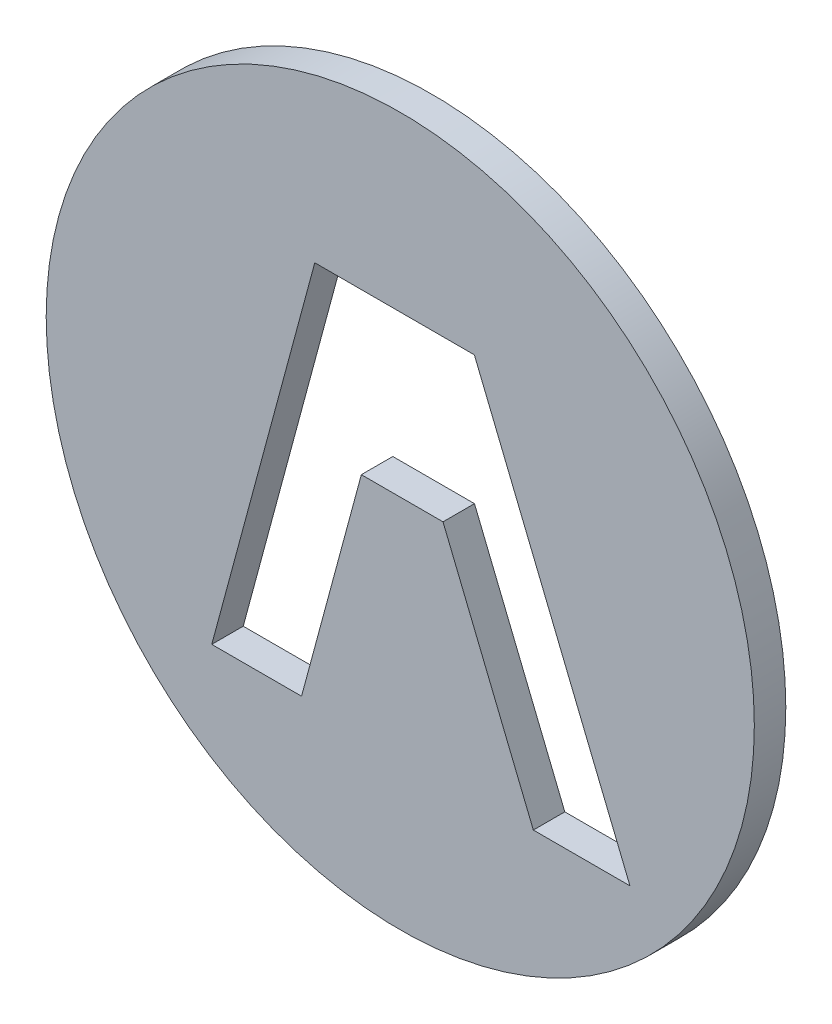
from build123d import *

# Parameters (mm, degrees)
SKETCH1_R           = 45
BOSS_EXTRUDE1_DEPTH = 4
CUT_EXTRUDE1_DEPTH  = 4


with BuildPart() as part:
    # Sketch1 → Boss-Extrude1 (new body)
    with BuildSketch(Plane.XY):
        with Locations((0, -3.473475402)):
            Circle(SKETCH1_R)
    extrude(amount=BOSS_EXTRUDE1_DEPTH)

    # Sketch2 → Cut-Extrude1 (cut)
    with BuildSketch(Plane.XY.offset(4)):
        Polygon((-10.863654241, 19.529806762), (-23.956431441, -29.022575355), (-12.547244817, -29.022575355), (-4.946568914, -0.836735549), (5.432045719, -0.836735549), (16.911503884, -29.022575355), (29.191665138, -29.022575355), (9.417372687, 19.529806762), align=None)
    extrude(amount=-CUT_EXTRUDE1_DEPTH, mode=Mode.SUBTRACT)


solid = part.part
